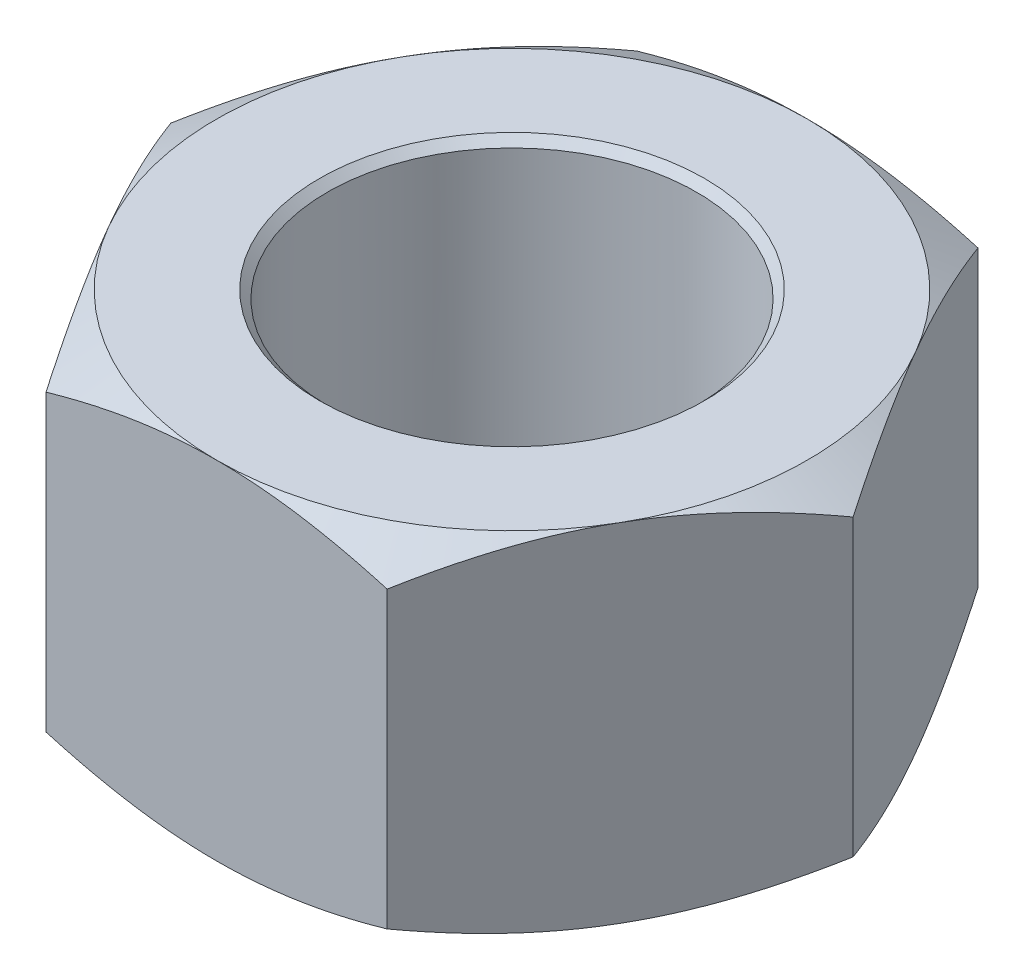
ISO-10303-21;
HEADER;
FILE_DESCRIPTION(('STEP AP214'),'2;1');
FILE_NAME('part.step','',(''),(''),'','','');
FILE_SCHEMA(('AUTOMOTIVE_DESIGN { 1 0 10303 214 1 1 1 1 }'));
ENDSEC;
DATA;
#1=APPLICATION_CONTEXT('core data for automotive mechanical design processes');
#2=APPLICATION_PROTOCOL_DEFINITION('international standard','automotive_design',2000,#1);
#3=PRODUCT_CONTEXT('',#1,'mechanical');
#4=PRODUCT('Part','Part','',(#3));
#5=PRODUCT_RELATED_PRODUCT_CATEGORY('part','',(#4));
#6=PRODUCT_DEFINITION_FORMATION('','',#4);
#7=PRODUCT_DEFINITION_CONTEXT('part definition',#1,'design');
#8=PRODUCT_DEFINITION('design','',#6,#7);
#9=PRODUCT_DEFINITION_SHAPE('','',#8);
#10=(LENGTH_UNIT() NAMED_UNIT(*) SI_UNIT(.MILLI.,.METRE.));
#11=(NAMED_UNIT(*) PLANE_ANGLE_UNIT() SI_UNIT($,.RADIAN.));
#12=(NAMED_UNIT(*) SI_UNIT($,.STERADIAN.) SOLID_ANGLE_UNIT());
#13=UNCERTAINTY_MEASURE_WITH_UNIT(LENGTH_MEASURE(1.E-05),#10,'distance_accuracy_value','');
#14=(GEOMETRIC_REPRESENTATION_CONTEXT(3) GLOBAL_UNCERTAINTY_ASSIGNED_CONTEXT((#13)) GLOBAL_UNIT_ASSIGNED_CONTEXT((#10,
#11,#12)) REPRESENTATION_CONTEXT('',''));
#15=CARTESIAN_POINT('',(0.,0.,0.));
#16=DIRECTION('',(0.,0.,1.));
#17=DIRECTION('',(1.,0.,0.));
#18=AXIS2_PLACEMENT_3D('',#15,#16,#17);
#19=CARTESIAN_POINT('',(0.,3.74341473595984,0.));
#20=DIRECTION('',(0.,-1.,0.));
#21=DIRECTION('',(0.,0.,-1.00000000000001));
#22=AXIS2_PLACEMENT_3D('',#19,#20,#21);
#23=CONICAL_SURFACE('',#22,5.65685424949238,1.04719754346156);
#24=CARTESIAN_POINT('',(-6.20839023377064,2.74543929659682,3.99999999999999));
#25=CARTESIAN_POINT('',(-6.03364521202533,2.83022662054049,3.99999999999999));
#26=CARTESIAN_POINT('',(-5.85849960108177,2.91420244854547,4.));
#27=CARTESIAN_POINT('',(-5.50719419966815,3.08007482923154,4.));
#28=CARTESIAN_POINT('',(-5.33103425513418,3.16197105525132,4.));
#29=CARTESIAN_POINT('',(-4.97658194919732,3.32363889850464,4.));
#30=CARTESIAN_POINT('',(-4.7982832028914,3.40339656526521,4.));
#31=CARTESIAN_POINT('',(-4.44026939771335,3.55965483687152,4.));
#32=CARTESIAN_POINT('',(-4.26055440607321,3.63615559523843,4.));
#33=CARTESIAN_POINT('',(-3.89359402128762,3.78744323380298,4.));
#34=CARTESIAN_POINT('',(-3.7062927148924,3.86209523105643,4.));
#35=CARTESIAN_POINT('',(-3.32950060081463,4.00576150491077,4.));
#36=CARTESIAN_POINT('',(-3.14000955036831,4.07477514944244,4.));
#37=CARTESIAN_POINT('',(-2.75888961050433,4.2053566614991,4.));
#38=CARTESIAN_POINT('',(-2.56726592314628,4.26693955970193,3.99999999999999));
#39=CARTESIAN_POINT('',(-2.18126966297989,4.38068672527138,4.));
#40=CARTESIAN_POINT('',(-1.98689797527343,4.43285395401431,4.));
#41=CARTESIAN_POINT('',(-1.59637994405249,4.5249904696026,4.));
#42=CARTESIAN_POINT('',(-1.40024960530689,4.56502634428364,4.));
#43=CARTESIAN_POINT('',(-1.00554432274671,4.63064250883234,3.99999999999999));
#44=CARTESIAN_POINT('',(-0.806969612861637,4.65622417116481,4.));
#45=CARTESIAN_POINT('',(-0.410963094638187,4.69055657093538,4.));
#46=CARTESIAN_POINT('',(-0.213550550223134,4.69952403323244,3.99999999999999));
#47=CARTESIAN_POINT('',(0.181330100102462,4.70043850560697,4.));
#48=CARTESIAN_POINT('',(0.378798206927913,4.69238521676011,4.00000000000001));
#49=CARTESIAN_POINT('',(0.713893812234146,4.66484679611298,4.));
#50=CARTESIAN_POINT('',(0.851879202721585,4.64946625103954,4.));
#51=CARTESIAN_POINT('',(1.12683713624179,4.61134898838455,3.99999999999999));
#52=CARTESIAN_POINT('',(1.2638095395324,4.58861127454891,3.99999999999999));
#53=CARTESIAN_POINT('',(1.6730269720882,4.51055772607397,4.));
#54=CARTESIAN_POINT('',(1.94341853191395,4.44541579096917,3.99999999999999));
#55=CARTESIAN_POINT('',(2.34772228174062,4.33249577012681,4.));
#56=CARTESIAN_POINT('',(2.4837313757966,4.29179820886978,4.));
#57=CARTESIAN_POINT('',(2.75442830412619,4.20618524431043,3.99999999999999));
#58=CARTESIAN_POINT('',(2.88911612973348,4.16126981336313,3.99999999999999));
#59=CARTESIAN_POINT('',(3.1572132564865,4.06794111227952,4.));
#60=CARTESIAN_POINT('',(3.29062296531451,4.01952900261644,4.00000000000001));
#61=CARTESIAN_POINT('',(3.55633779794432,3.91977556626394,3.99999999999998));
#62=CARTESIAN_POINT('',(3.68864293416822,3.86843427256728,3.99999999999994));
#63=CARTESIAN_POINT('',(3.99869432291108,3.74479696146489,3.99999999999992));
#64=CARTESIAN_POINT('',(4.17603604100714,3.67148839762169,3.99999999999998));
#65=CARTESIAN_POINT('',(4.52922449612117,3.52134465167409,4.00000000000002));
#66=CARTESIAN_POINT('',(4.70507114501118,3.44450926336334,4.));
#67=CARTESIAN_POINT('',(5.05554185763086,3.28801427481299,3.99999999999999));
#68=CARTESIAN_POINT('',(5.23016567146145,3.20835411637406,3.99999999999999));
#69=CARTESIAN_POINT('',(5.57836241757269,3.04676587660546,4.));
#70=CARTESIAN_POINT('',(5.75193532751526,2.96483774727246,4.));
#71=CARTESIAN_POINT('',(6.27167633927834,2.71614673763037,3.99999999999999));
#72=CARTESIAN_POINT('',(6.61652656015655,2.54663124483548,3.99999999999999));
#73=CARTESIAN_POINT('',(7.30373366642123,2.20262130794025,3.99999999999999));
#74=CARTESIAN_POINT('',(7.64609046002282,2.02812668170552,3.99999999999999));
#75=CARTESIAN_POINT('',(8.30062488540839,1.69022939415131,3.99999999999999));
#76=CARTESIAN_POINT('',(8.61294829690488,1.52710859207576,3.99999999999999));
#77=CARTESIAN_POINT('',(9.23642594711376,1.19862534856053,3.99999999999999));
#78=CARTESIAN_POINT('',(9.54758014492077,1.03326282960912,3.99999999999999));
#79=CARTESIAN_POINT('',(10.168207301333,0.701236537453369,3.99999999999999));
#80=CARTESIAN_POINT('',(10.4776825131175,0.534576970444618,3.99999999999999));
#81=CARTESIAN_POINT('',(11.095883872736,0.199913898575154,3.99999999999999));
#82=CARTESIAN_POINT('',(11.4046100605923,0.0319104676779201,3.99999999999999));
#83=CARTESIAN_POINT('',(11.7130599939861,-0.136594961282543,3.99999999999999));
#84=B_SPLINE_CURVE_WITH_KNOTS('',3,(#24,#25,#26,#27,#28,#29,#30,#31,#32,#33,#34,#35,#36,#37,#38,
#39,#40,#41,#42,#43,#44,#45,#46,#47,#48,#49,#50,#51,#52,#53,#54,#55,#56,#57,#58,#59,#60,#61,#62,
#63,#64,#65,#66,#67,#68,#69,#70,#71,#72,#73,#74,#75,#76,#77,#78,#79,#80,#81,#82,#83),
.UNSPECIFIED.,.F.,.F.,(4,2,2,2,2,2,2,2,2,2,2,2,2,2,2,2,2,2,2,2,2,2,2,2,2,2,2,2,2,4),(0.,
0.58269261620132,1.16547620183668,1.75142413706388,2.33734442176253,2.94216458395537,
3.54705245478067,4.15069550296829,4.7541483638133,5.35422628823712,5.95424722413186,
6.5463845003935,7.13853217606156,7.55485008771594,7.97122439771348,8.80443398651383,
9.23030042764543,9.65616966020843,10.0818981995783,10.507621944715,11.0832599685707,
11.6589316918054,12.2347178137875,12.8105161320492,13.9632327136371,15.1159915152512,
16.1730456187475,17.2301363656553,18.2846244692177,19.3390549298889),.UNSPECIFIED.);
#85=CARTESIAN_POINT('',(0.,4.7,4.));
#86=VERTEX_POINT('',#85);
#87=CARTESIAN_POINT('',(2.30940107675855,4.3427344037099,3.99999999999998));
#88=VERTEX_POINT('',#87);
#89=EDGE_CURVE('E138',#86,#88,#84,.T.);
#90=ORIENTED_EDGE('',*,*,#89,.T.);
#91=CARTESIAN_POINT('',(2.30928560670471,4.3426677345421,4.00019999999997));
#92=CARTESIAN_POINT('',(2.41077174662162,4.40128212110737,3.82442084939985));
#93=CARTESIAN_POINT('',(2.51313390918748,4.45458967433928,3.64712438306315));
#94=CARTESIAN_POINT('',(2.71963072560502,4.54763832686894,3.28946140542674));
#95=CARTESIAN_POINT('',(2.82376904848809,4.58734650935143,3.10908853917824));
#96=CARTESIAN_POINT('',(3.03075510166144,4.64915778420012,2.75057817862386));
#97=CARTESIAN_POINT('',(3.13357098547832,4.6716722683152,2.57249584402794));
#98=CARTESIAN_POINT('',(3.33968651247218,4.69854937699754,2.21549327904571));
#99=CARTESIAN_POINT('',(3.44298540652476,4.70293425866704,2.03657434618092));
#100=CARTESIAN_POINT('',(3.63600352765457,4.69380992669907,1.7022571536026));
#101=CARTESIAN_POINT('',(3.72575165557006,4.68254104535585,1.54680883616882));
#102=CARTESIAN_POINT('',(3.90466320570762,4.64682600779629,1.23692494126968));
#103=CARTESIAN_POINT('',(3.99382600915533,4.62236765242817,1.08249043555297));
#104=CARTESIAN_POINT('',(4.17310641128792,4.56122393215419,0.771967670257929));
#105=CARTESIAN_POINT('',(4.26320132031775,4.5242793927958,0.615918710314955));
#106=CARTESIAN_POINT('',(4.44204742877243,4.44042992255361,0.306148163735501));
#107=CARTESIAN_POINT('',(4.53080091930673,4.39354469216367,0.152422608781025));
#108=CARTESIAN_POINT('',(4.6189176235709,4.3426677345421,-0.000200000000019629));
#109=B_SPLINE_CURVE_WITH_KNOTS('',3,(#91,#92,#93,#94,#95,#96,#97,#98,#99,#100,#101,#102,#103,
#104,#105,#106,#107,#108),.UNSPECIFIED.,.F.,.F.,(4,2,2,2,2,2,2,2,4),(0.,0.634047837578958,
1.26961969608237,1.88946157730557,2.50854227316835,3.04757825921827,3.58711366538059,
4.13861653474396,4.6890364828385),.UNSPECIFIED.);
#110=CARTESIAN_POINT('',(3.46410161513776,4.7,1.99999999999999));
#111=VERTEX_POINT('',#110);
#112=EDGE_CURVE('E147',#88,#111,#109,.T.);
#113=ORIENTED_EDGE('',*,*,#112,.T.);
#114=CARTESIAN_POINT('',(0.,4.7,0.));
#115=DIRECTION('',(0.,1.,0.));
#116=DIRECTION('',(0.,0.,1.00000000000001));
#117=AXIS2_PLACEMENT_3D('',#114,#115,#116);
#118=CIRCLE('',#117,4.);
#119=EDGE_CURVE('E158',#86,#111,#118,.T.);
#120=ORIENTED_EDGE('',*,*,#119,.F.);
#121=EDGE_LOOP('',(#90,#113,#120));
#122=FACE_BOUND('',#121,.T.);
#123=ADVANCED_FACE('F35',(#122),#23,.T.);
#124=CARTESIAN_POINT('',(3.46410161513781,4.7000000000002,-2.00000000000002));
#125=VERTEX_POINT('',#124);
#126=EDGE_CURVE('E170',#111,#125,#118,.T.);
#127=ORIENTED_EDGE('',*,*,#126,.F.);
#128=CARTESIAN_POINT('',(4.61880215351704,4.3427344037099,0.));
#129=VERTEX_POINT('',#128);
#130=EDGE_CURVE('E161',#111,#129,#109,.T.);
#131=ORIENTED_EDGE('',*,*,#130,.T.);
#132=CARTESIAN_POINT('',(4.61891762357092,4.3426677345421,0.000199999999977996));
#133=CARTESIAN_POINT('',(4.517431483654,4.40128212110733,-0.175579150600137));
#134=CARTESIAN_POINT('',(4.41506932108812,4.45458967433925,-0.352875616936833));
#135=CARTESIAN_POINT('',(4.20857250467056,4.54763832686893,-0.710538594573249));
#136=CARTESIAN_POINT('',(4.10443418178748,4.58734650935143,-0.89091146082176));
#137=CARTESIAN_POINT('',(3.89744812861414,4.64915778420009,-1.24942182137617));
#138=CARTESIAN_POINT('',(3.79463224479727,4.67167226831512,-1.4275041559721));
#139=CARTESIAN_POINT('',(3.58851671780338,4.69854937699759,-1.78450672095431));
#140=CARTESIAN_POINT('',(3.48521782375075,4.70293425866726,-1.96342565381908));
#141=CARTESIAN_POINT('',(3.29219970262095,4.69380992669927,-2.29774284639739));
#142=CARTESIAN_POINT('',(3.20245157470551,4.68254104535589,-2.45319116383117));
#143=CARTESIAN_POINT('',(3.02354002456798,4.64682600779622,-2.76307505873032));
#144=CARTESIAN_POINT('',(2.93437722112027,4.62236765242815,-2.91750956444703));
#145=CARTESIAN_POINT('',(2.75509681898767,4.56122393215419,-3.22803232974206));
#146=CARTESIAN_POINT('',(2.66500190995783,4.52427939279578,-3.38408128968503));
#147=CARTESIAN_POINT('',(2.48615580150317,4.44042992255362,-3.6938518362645));
#148=CARTESIAN_POINT('',(2.39740231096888,4.39354469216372,-3.847577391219));
#149=CARTESIAN_POINT('',(2.30928560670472,4.34266773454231,-4.00020000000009));
#150=B_SPLINE_CURVE_WITH_KNOTS('',3,(#132,#133,#134,#135,#136,#137,#138,#139,#140,#141,#142,
#143,#144,#145,#146,#147,#148,#149),.UNSPECIFIED.,.F.,.F.,(4,2,2,2,2,2,2,2,4),(0.,
0.634047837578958,1.26961969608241,1.88946157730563,2.5085422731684,3.04757825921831,
3.58711366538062,4.13861653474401,4.68903648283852),.UNSPECIFIED.);
#151=EDGE_CURVE('E240',#129,#125,#150,.T.);
#152=ORIENTED_EDGE('',*,*,#151,.T.);
#153=EDGE_LOOP('',(#127,#131,#152));
#154=FACE_BOUND('',#153,.T.);
#155=ADVANCED_FACE('F191',(#154),#23,.T.);
#156=CARTESIAN_POINT('',(0.,4.7000000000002,-3.99999999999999));
#157=VERTEX_POINT('',#156);
#158=EDGE_CURVE('E233',#125,#157,#118,.T.);
#159=ORIENTED_EDGE('',*,*,#158,.F.);
#160=CARTESIAN_POINT('',(2.30940107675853,4.34273440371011,-4.00000000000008));
#161=VERTEX_POINT('',#160);
#162=EDGE_CURVE('E244',#125,#161,#150,.T.);
#163=ORIENTED_EDGE('',*,*,#162,.T.);
#164=CARTESIAN_POINT('',(-6.20839023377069,2.74543929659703,-4.00000000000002));
#165=CARTESIAN_POINT('',(-6.03364521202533,2.83022662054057,-4.00000000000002));
#166=CARTESIAN_POINT('',(-5.85849960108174,2.9142024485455,-4.00000000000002));
#167=CARTESIAN_POINT('',(-5.50719419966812,3.08007482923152,-4.00000000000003));
#168=CARTESIAN_POINT('',(-5.33103425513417,3.16197105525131,-4.00000000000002));
#169=CARTESIAN_POINT('',(-4.97658194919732,3.32363889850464,-4.00000000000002));
#170=CARTESIAN_POINT('',(-4.79828320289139,3.40339656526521,-4.00000000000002));
#171=CARTESIAN_POINT('',(-4.44026939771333,3.55965483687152,-4.00000000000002));
#172=CARTESIAN_POINT('',(-4.26055440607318,3.63615559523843,-4.00000000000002));
#173=CARTESIAN_POINT('',(-3.89359402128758,3.78744323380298,-4.00000000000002));
#174=CARTESIAN_POINT('',(-3.70629271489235,3.86209523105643,-4.00000000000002));
#175=CARTESIAN_POINT('',(-3.32950060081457,4.00576150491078,-4.00000000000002));
#176=CARTESIAN_POINT('',(-3.14000955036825,4.07477514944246,-4.00000000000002));
#177=CARTESIAN_POINT('',(-2.75888961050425,4.2053566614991,-4.00000000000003));
#178=CARTESIAN_POINT('',(-2.5672659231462,4.26693955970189,-4.00000000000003));
#179=CARTESIAN_POINT('',(-2.18126966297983,4.38068672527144,-4.00000000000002));
#180=CARTESIAN_POINT('',(-1.98689797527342,4.43285395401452,-3.99999999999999));
#181=CARTESIAN_POINT('',(-1.5963799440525,4.52499046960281,-3.99999999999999));
#182=CARTESIAN_POINT('',(-1.40024960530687,4.56502634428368,-4.00000000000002));
#183=CARTESIAN_POINT('',(-1.00554432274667,4.63064250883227,-4.00000000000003));
#184=CARTESIAN_POINT('',(-0.806969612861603,4.6562241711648,-4.00000000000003));
#185=CARTESIAN_POINT('',(-0.410963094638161,4.69055657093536,-4.00000000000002));
#186=CARTESIAN_POINT('',(-0.213550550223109,4.69952403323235,-4.00000000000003));
#187=CARTESIAN_POINT('',(0.181330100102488,4.70043850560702,-4.00000000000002));
#188=CARTESIAN_POINT('',(0.378798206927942,4.69238521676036,-4.00000000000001));
#189=CARTESIAN_POINT('',(0.713893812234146,4.66484679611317,-4.00000000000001));
#190=CARTESIAN_POINT('',(0.851879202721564,4.64946625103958,-4.00000000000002));
#191=CARTESIAN_POINT('',(1.12683713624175,4.61134898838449,-4.00000000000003));
#192=CARTESIAN_POINT('',(1.26380953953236,4.58861127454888,-4.00000000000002));
#193=CARTESIAN_POINT('',(1.67302697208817,4.510557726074,-4.00000000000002));
#194=CARTESIAN_POINT('',(1.94341853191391,4.44541579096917,-4.00000000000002));
#195=CARTESIAN_POINT('',(2.34772228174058,4.3324957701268,-4.00000000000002));
#196=CARTESIAN_POINT('',(2.48373137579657,4.29179820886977,-4.00000000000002));
#197=CARTESIAN_POINT('',(2.75442830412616,4.20618524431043,-4.00000000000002));
#198=CARTESIAN_POINT('',(2.88911612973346,4.16126981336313,-4.00000000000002));
#199=CARTESIAN_POINT('',(3.15721325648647,4.06794111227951,-4.00000000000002));
#200=CARTESIAN_POINT('',(3.29062296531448,4.01952900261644,-4.00000000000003));
#201=CARTESIAN_POINT('',(3.5563377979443,3.91977556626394,-4.00000000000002));
#202=CARTESIAN_POINT('',(3.68864293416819,3.86843427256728,-4.));
#203=CARTESIAN_POINT('',(3.99869432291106,3.74479696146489,-4.));
#204=CARTESIAN_POINT('',(4.17603604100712,3.67148839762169,-4.00000000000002));
#205=CARTESIAN_POINT('',(4.52922449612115,3.52134465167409,-4.00000000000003));
#206=CARTESIAN_POINT('',(4.70507114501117,3.44450926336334,-4.00000000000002));
#207=CARTESIAN_POINT('',(5.05554185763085,3.28801427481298,-4.00000000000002));
#208=CARTESIAN_POINT('',(5.23016567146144,3.20835411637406,-4.00000000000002));
#209=CARTESIAN_POINT('',(5.57836241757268,3.04676587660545,-4.00000000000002));
#210=CARTESIAN_POINT('',(5.75193532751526,2.96483774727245,-4.00000000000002));
#211=CARTESIAN_POINT('',(6.27167633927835,2.71614673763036,-4.00000000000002));
#212=CARTESIAN_POINT('',(6.61652656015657,2.54663124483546,-4.00000000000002));
#213=CARTESIAN_POINT('',(7.30373366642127,2.20262130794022,-4.00000000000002));
#214=CARTESIAN_POINT('',(7.64609046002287,2.02812668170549,-4.00000000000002));
#215=CARTESIAN_POINT('',(8.30062488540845,1.69022939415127,-4.00000000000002));
#216=CARTESIAN_POINT('',(8.61294829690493,1.52710859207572,-4.00000000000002));
#217=CARTESIAN_POINT('',(9.23642594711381,1.1986253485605,-4.00000000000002));
#218=CARTESIAN_POINT('',(9.54758014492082,1.03326282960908,-4.00000000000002));
#219=CARTESIAN_POINT('',(10.168207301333,0.701236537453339,-4.00000000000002));
#220=CARTESIAN_POINT('',(10.4776825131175,0.53457697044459,-4.00000000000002));
#221=CARTESIAN_POINT('',(11.095883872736,0.199913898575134,-4.00000000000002));
#222=CARTESIAN_POINT('',(11.4046100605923,0.0319104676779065,-4.00000000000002));
#223=CARTESIAN_POINT('',(11.7130599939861,-0.136594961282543,-4.00000000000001));
#224=B_SPLINE_CURVE_WITH_KNOTS('',3,(#164,#165,#166,#167,#168,#169,#170,#171,#172,#173,#174,
#175,#176,#177,#178,#179,#180,#181,#182,#183,#184,#185,#186,#187,#188,#189,#190,#191,#192,#193,
#194,#195,#196,#197,#198,#199,#200,#201,#202,#203,#204,#205,#206,#207,#208,#209,#210,#211,#212,
#213,#214,#215,#216,#217,#218,#219,#220,#221,#222,#223),.UNSPECIFIED.,.F.,.F.,(4,2,2,2,2,2,2,2,
2,2,2,2,2,2,2,2,2,2,2,2,2,2,2,2,2,2,2,2,2,4),(0.,0.582692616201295,1.16547620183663,
1.75142413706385,2.33734442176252,2.94216458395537,3.54705245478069,4.15069550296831,
4.7541483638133,5.35422628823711,5.95424722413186,6.54638450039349,7.13853217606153,
7.55485008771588,7.97122439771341,8.80443398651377,9.23030042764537,9.65616966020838,
10.0818981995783,10.507621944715,11.0832599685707,11.6589316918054,12.2347178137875,
12.8105161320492,13.9632327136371,15.1159915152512,16.1730456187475,17.2301363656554,
18.2846244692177,19.3390549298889),.UNSPECIFIED.);
#225=EDGE_CURVE('E249',#161,#157,#224,.F.);
#226=ORIENTED_EDGE('',*,*,#225,.T.);
#227=EDGE_LOOP('',(#159,#163,#226));
#228=FACE_BOUND('',#227,.T.);
#229=ADVANCED_FACE('F197',(#228),#23,.T.);
#230=CARTESIAN_POINT('',(-3.46410161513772,4.7,-1.99999999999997));
#231=VERTEX_POINT('',#230);
#232=EDGE_CURVE('E228',#157,#231,#118,.T.);
#233=ORIENTED_EDGE('',*,*,#232,.F.);
#234=CARTESIAN_POINT('',(-2.30940107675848,4.34273440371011,-4.00000000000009));
#235=VERTEX_POINT('',#234);
#236=EDGE_CURVE('E254',#157,#235,#224,.F.);
#237=ORIENTED_EDGE('',*,*,#236,.T.);
#238=CARTESIAN_POINT('',(-2.30928560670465,4.34266773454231,-4.00020000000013));
#239=CARTESIAN_POINT('',(-2.41077174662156,4.40128212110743,-3.82442084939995));
#240=CARTESIAN_POINT('',(-2.51313390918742,4.45458967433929,-3.64712438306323));
#241=CARTESIAN_POINT('',(-2.71963072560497,4.54763832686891,-3.28946140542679));
#242=CARTESIAN_POINT('',(-2.82376904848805,4.58734650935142,-3.10908853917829));
#243=CARTESIAN_POINT('',(-3.0307551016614,4.64915778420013,-2.7505781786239));
#244=CARTESIAN_POINT('',(-3.13357098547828,4.67167226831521,-2.57249584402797));
#245=CARTESIAN_POINT('',(-3.33968651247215,4.69854937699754,-2.21549327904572));
#246=CARTESIAN_POINT('',(-3.44298540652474,4.70293425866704,-2.03657434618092));
#247=CARTESIAN_POINT('',(-3.63600352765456,4.69380992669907,-1.7022571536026));
#248=CARTESIAN_POINT('',(-3.72575165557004,4.68254104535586,-1.54680883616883));
#249=CARTESIAN_POINT('',(-3.9046632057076,4.6468260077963,-1.23692494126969));
#250=CARTESIAN_POINT('',(-3.9938260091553,4.62236765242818,-1.08249043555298));
#251=CARTESIAN_POINT('',(-4.17310641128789,4.56122393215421,-0.771967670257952));
#252=CARTESIAN_POINT('',(-4.26320132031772,4.52427939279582,-0.615918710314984));
#253=CARTESIAN_POINT('',(-4.44204742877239,4.44042992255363,-0.306148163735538));
#254=CARTESIAN_POINT('',(-4.53080091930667,4.39354469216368,-0.152422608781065));
#255=CARTESIAN_POINT('',(-4.61891762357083,4.3426677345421,0.000199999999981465));
#256=B_SPLINE_CURVE_WITH_KNOTS('',3,(#238,#239,#240,#241,#242,#243,#244,#245,#246,#247,#248,
#249,#250,#251,#252,#253,#254,#255),.UNSPECIFIED.,.F.,.F.,(4,2,2,2,2,2,2,2,4),(0.,
0.634047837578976,1.26961969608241,1.88946157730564,2.50854227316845,3.04757825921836,
3.58711366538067,4.13861653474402,4.68903648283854),.UNSPECIFIED.);
#257=EDGE_CURVE('E327',#235,#231,#256,.T.);
#258=ORIENTED_EDGE('',*,*,#257,.T.);
#259=EDGE_LOOP('',(#233,#237,#258));
#260=FACE_BOUND('',#259,.T.);
#261=ADVANCED_FACE('F212',(#260),#23,.T.);
#262=CARTESIAN_POINT('',(-3.46410161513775,4.7,1.99999999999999));
#263=VERTEX_POINT('',#262);
#264=EDGE_CURVE('E156',#231,#263,#118,.T.);
#265=ORIENTED_EDGE('',*,*,#264,.F.);
#266=CARTESIAN_POINT('',(-4.61880215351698,4.3427344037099,0.));
#267=VERTEX_POINT('',#266);
#268=EDGE_CURVE('E226',#231,#267,#256,.T.);
#269=ORIENTED_EDGE('',*,*,#268,.T.);
#270=CARTESIAN_POINT('',(-4.61891762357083,4.3426677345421,-0.000200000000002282));
#271=CARTESIAN_POINT('',(-4.51743148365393,4.40128212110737,0.175579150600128));
#272=CARTESIAN_POINT('',(-4.41506932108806,4.45458967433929,0.352875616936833));
#273=CARTESIAN_POINT('',(-4.20857250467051,4.54763832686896,0.710538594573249));
#274=CARTESIAN_POINT('',(-4.10443418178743,4.58734650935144,0.89091146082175));
#275=CARTESIAN_POINT('',(-3.89744812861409,4.64915778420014,1.24942182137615));
#276=CARTESIAN_POINT('',(-3.79463224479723,4.67167226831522,1.42750415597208));
#277=CARTESIAN_POINT('',(-3.58851671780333,4.69854937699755,1.7845067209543));
#278=CARTESIAN_POINT('',(-3.4852178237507,4.70293425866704,1.96342565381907));
#279=CARTESIAN_POINT('',(-3.29219970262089,4.69380992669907,2.29774284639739));
#280=CARTESIAN_POINT('',(-3.20245157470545,4.68254104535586,2.45319116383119));
#281=CARTESIAN_POINT('',(-3.02354002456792,4.6468260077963,2.76307505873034));
#282=CARTESIAN_POINT('',(-2.93437722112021,4.62236765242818,2.91750956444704));
#283=CARTESIAN_POINT('',(-2.75509681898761,4.5612239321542,3.22803232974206));
#284=CARTESIAN_POINT('',(-2.66500190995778,4.52427939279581,3.38408128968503));
#285=CARTESIAN_POINT('',(-2.48615580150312,4.44042992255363,3.69385183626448));
#286=CARTESIAN_POINT('',(-2.39740231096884,4.39354469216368,3.84757739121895));
#287=CARTESIAN_POINT('',(-2.30928560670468,4.3426677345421,4.0002));
#288=B_SPLINE_CURVE_WITH_KNOTS('',3,(#270,#271,#272,#273,#274,#275,#276,#277,#278,#279,#280,
#281,#282,#283,#284,#285,#286,#287),.UNSPECIFIED.,.F.,.F.,(4,2,2,2,2,2,2,2,4),(0.,
0.634047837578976,1.2696196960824,1.88946157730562,2.50854227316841,3.04757825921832,
3.58711366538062,4.13861653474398,4.68903648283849),.UNSPECIFIED.);
#289=EDGE_CURVE('E227',#267,#263,#288,.T.);
#290=ORIENTED_EDGE('',*,*,#289,.T.);
#291=EDGE_LOOP('',(#265,#269,#290));
#292=FACE_BOUND('',#291,.T.);
#293=ADVANCED_FACE('F204',(#292),#23,.T.);
#294=CARTESIAN_POINT('',(0.,0.,0.));
#295=DIRECTION('',(0.,1.,0.));
#296=DIRECTION('',(0.,0.,1.00000000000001));
#297=AXIS2_PLACEMENT_3D('',#294,#295,#296);
#298=CONICAL_SURFACE('',#297,4.,1.04719754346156);
#299=CARTESIAN_POINT('',(-4.61891762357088,0.357332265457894,0.000199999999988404));
#300=CARTESIAN_POINT('',(-4.51743148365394,0.298717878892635,-0.175579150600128));
#301=CARTESIAN_POINT('',(-4.41506932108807,0.245410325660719,-0.352875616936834));
#302=CARTESIAN_POINT('',(-4.20857250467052,0.152361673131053,-0.710538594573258));
#303=CARTESIAN_POINT('',(-4.10443418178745,0.112653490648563,-0.890911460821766));
#304=CARTESIAN_POINT('',(-3.89744812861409,0.050842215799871,-1.24942182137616));
#305=CARTESIAN_POINT('',(-3.7946322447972,0.0283277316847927,-1.42750415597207));
#306=CARTESIAN_POINT('',(-3.58851671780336,0.00145062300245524,-1.78450672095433));
#307=CARTESIAN_POINT('',(-3.48521782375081,-0.00293425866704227,-1.96342565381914));
#308=CARTESIAN_POINT('',(-3.29219970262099,0.00619007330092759,-2.29774284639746));
#309=CARTESIAN_POINT('',(-3.20245157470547,0.0174589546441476,-2.45319116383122));
#310=CARTESIAN_POINT('',(-3.02354002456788,0.0531739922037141,-2.76307505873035));
#311=CARTESIAN_POINT('',(-2.93437722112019,0.0776323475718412,-2.91750956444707));
#312=CARTESIAN_POINT('',(-2.7550968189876,0.13877606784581,-3.22803232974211));
#313=CARTESIAN_POINT('',(-2.66500190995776,0.175720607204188,-3.38408128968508));
#314=CARTESIAN_POINT('',(-2.4861558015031,0.259570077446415,-3.69385183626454));
#315=CARTESIAN_POINT('',(-2.39740231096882,0.306455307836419,-3.84757739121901));
#316=CARTESIAN_POINT('',(-2.30928560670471,0.357332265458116,-4.00020000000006));
#317=B_SPLINE_CURVE_WITH_KNOTS('',3,(#299,#300,#301,#302,#303,#304,#305,#306,#307,#308,#309,
#310,#311,#312,#313,#314,#315,#316),.UNSPECIFIED.,.F.,.F.,(4,2,2,2,2,2,2,2,4),(0.,
0.634047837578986,1.26961969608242,1.88946157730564,2.50854227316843,3.04757825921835,
3.58711366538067,4.13861653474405,4.68903648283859),.UNSPECIFIED.);
#318=CARTESIAN_POINT('',(-3.46410161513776,0.,-1.99999999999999));
#319=VERTEX_POINT('',#318);
#320=CARTESIAN_POINT('',(-2.30940107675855,0.357265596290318,-4.00000000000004));
#321=VERTEX_POINT('',#320);
#322=EDGE_CURVE('E314',#319,#321,#317,.T.);
#323=ORIENTED_EDGE('',*,*,#322,.T.);
#324=CARTESIAN_POINT('',(-6.20839023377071,1.95456070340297,-4.00000000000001));
#325=CARTESIAN_POINT('',(-6.03364521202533,1.86977337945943,-4.00000000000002));
#326=CARTESIAN_POINT('',(-5.85849960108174,1.78579755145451,-4.00000000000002));
#327=CARTESIAN_POINT('',(-5.50719419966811,1.61992517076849,-4.00000000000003));
#328=CARTESIAN_POINT('',(-5.33103425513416,1.53802894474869,-4.00000000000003));
#329=CARTESIAN_POINT('',(-4.97658194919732,1.37636110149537,-4.00000000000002));
#330=CARTESIAN_POINT('',(-4.7982832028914,1.29660343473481,-4.00000000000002));
#331=CARTESIAN_POINT('',(-4.44026939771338,1.14034516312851,-4.00000000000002));
#332=CARTESIAN_POINT('',(-4.26055440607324,1.0638444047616,-4.00000000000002));
#333=CARTESIAN_POINT('',(-3.89359402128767,0.912556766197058,-4.00000000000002));
#334=CARTESIAN_POINT('',(-3.70629271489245,0.837904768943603,-4.00000000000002));
#335=CARTESIAN_POINT('',(-3.32950060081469,0.694238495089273,-4.00000000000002));
#336=CARTESIAN_POINT('',(-3.14000955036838,0.625224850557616,-4.00000000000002));
#337=CARTESIAN_POINT('',(-2.75888961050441,0.494643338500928,-4.00000000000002));
#338=CARTESIAN_POINT('',(-2.56726592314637,0.433060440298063,-4.00000000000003));
#339=CARTESIAN_POINT('',(-2.18126966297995,0.319313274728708,-4.00000000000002));
#340=CARTESIAN_POINT('',(-1.98689797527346,0.267146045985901,-4.00000000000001));
#341=CARTESIAN_POINT('',(-1.59637994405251,0.175009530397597,-4.00000000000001));
#342=CARTESIAN_POINT('',(-1.40024960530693,0.134973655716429,-4.00000000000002));
#343=CARTESIAN_POINT('',(-1.00554432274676,0.0693574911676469,-4.00000000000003));
#344=CARTESIAN_POINT('',(-0.806969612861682,0.0437758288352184,-4.00000000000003));
#345=CARTESIAN_POINT('',(-0.410963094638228,0.00944342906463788,-4.00000000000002));
#346=CARTESIAN_POINT('',(-0.213550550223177,0.000475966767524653,-4.00000000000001));
#347=CARTESIAN_POINT('',(0.181330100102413,-0.000438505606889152,-4.00000000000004));
#348=CARTESIAN_POINT('',(0.37879820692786,0.00761478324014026,-4.00000000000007));
#349=CARTESIAN_POINT('',(0.713893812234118,0.0351532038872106,-4.00000000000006));
#350=CARTESIAN_POINT('',(0.85187920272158,0.0505337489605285,-4.00000000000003));
#351=CARTESIAN_POINT('',(1.12683713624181,0.0886510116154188,-4.00000000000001));
#352=CARTESIAN_POINT('',(1.26380953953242,0.1113887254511,-4.00000000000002));
#353=CARTESIAN_POINT('',(1.67302697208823,0.189442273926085,-4.00000000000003));
#354=CARTESIAN_POINT('',(1.94341853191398,0.254584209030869,-4.00000000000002));
#355=CARTESIAN_POINT('',(2.34772228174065,0.367504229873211,-4.00000000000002));
#356=CARTESIAN_POINT('',(2.48373137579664,0.408201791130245,-4.00000000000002));
#357=CARTESIAN_POINT('',(2.75442830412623,0.493814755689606,-4.00000000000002));
#358=CARTESIAN_POINT('',(2.88911612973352,0.53873018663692,-4.00000000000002));
#359=CARTESIAN_POINT('',(3.15721325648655,0.632058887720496,-4.00000000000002));
#360=CARTESIAN_POINT('',(3.2906229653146,0.680470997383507,-4.00000000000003));
#361=CARTESIAN_POINT('',(3.55633779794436,0.780224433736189,-4.00000000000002));
#362=CARTESIAN_POINT('',(3.68864293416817,0.83156572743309,-4.00000000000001));
#363=CARTESIAN_POINT('',(3.99869432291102,0.955203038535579,-4.00000000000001));
#364=CARTESIAN_POINT('',(4.17603604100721,1.02851160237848,-4.00000000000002));
#365=CARTESIAN_POINT('',(4.52922449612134,1.17865534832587,-4.00000000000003));
#366=CARTESIAN_POINT('',(4.70507114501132,1.2554907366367,-4.00000000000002));
#367=CARTESIAN_POINT('',(5.05554185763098,1.41198572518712,-4.00000000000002));
#368=CARTESIAN_POINT('',(5.23016567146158,1.49164588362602,-4.00000000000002));
#369=CARTESIAN_POINT('',(5.57836241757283,1.65323412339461,-4.00000000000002));
#370=CARTESIAN_POINT('',(5.7519353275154,1.73516225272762,-4.00000000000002));
#371=CARTESIAN_POINT('',(6.27167633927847,1.98385326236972,-4.00000000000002));
#372=CARTESIAN_POINT('',(6.61652656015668,2.1533687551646,-4.00000000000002));
#373=CARTESIAN_POINT('',(7.30373366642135,2.49737869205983,-4.00000000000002));
#374=CARTESIAN_POINT('',(7.64609046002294,2.67187331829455,-4.00000000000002));
#375=CARTESIAN_POINT('',(8.30062488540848,3.00977060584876,-4.00000000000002));
#376=CARTESIAN_POINT('',(8.61294829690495,3.1728914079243,-4.00000000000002));
#377=CARTESIAN_POINT('',(9.2364259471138,3.5013746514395,-4.00000000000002));
#378=CARTESIAN_POINT('',(9.54758014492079,3.66673717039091,-4.00000000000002));
#379=CARTESIAN_POINT('',(10.168207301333,3.99876346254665,-4.00000000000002));
#380=CARTESIAN_POINT('',(10.4776825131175,4.1654230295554,-4.00000000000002));
#381=CARTESIAN_POINT('',(11.095883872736,4.50008610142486,-4.00000000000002));
#382=CARTESIAN_POINT('',(11.4046100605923,4.66808953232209,-4.00000000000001));
#383=CARTESIAN_POINT('',(11.713059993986,4.83659496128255,-4.));
#384=B_SPLINE_CURVE_WITH_KNOTS('',3,(#324,#325,#326,#327,#328,#329,#330,#331,#332,#333,#334,
#335,#336,#337,#338,#339,#340,#341,#342,#343,#344,#345,#346,#347,#348,#349,#350,#351,#352,#353,
#354,#355,#356,#357,#358,#359,#360,#361,#362,#363,#364,#365,#366,#367,#368,#369,#370,#371,#372,
#373,#374,#375,#376,#377,#378,#379,#380,#381,#382,#383),.UNSPECIFIED.,.F.,.F.,(4,2,2,2,2,2,2,2,
2,2,2,2,2,2,2,2,2,2,2,2,2,2,2,2,2,2,2,2,2,4),(0.,0.582692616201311,1.16547620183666,
1.75142413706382,2.33734442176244,2.94216458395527,3.54705245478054,4.15069550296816,
4.75414836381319,5.35422628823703,5.95424722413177,6.54638450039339,7.13853217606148,
7.55485008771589,7.97122439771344,8.8044339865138,9.23030042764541,9.65616966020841,
10.0818981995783,10.5076219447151,11.0832599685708,11.6589316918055,12.2347178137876,
12.8105161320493,13.9632327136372,15.1159915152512,16.1730456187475,17.2301363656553,
18.2846244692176,19.3390549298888),.UNSPECIFIED.);
#385=CARTESIAN_POINT('',(0.,2.08166817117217E-13,-4.00000000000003));
#386=VERTEX_POINT('',#385);
#387=EDGE_CURVE('E259',#321,#386,#384,.T.);
#388=ORIENTED_EDGE('',*,*,#387,.T.);
#389=CARTESIAN_POINT('',(0.,0.,0.));
#390=DIRECTION('',(0.,1.,0.));
#391=DIRECTION('',(0.,0.,1.00000000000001));
#392=AXIS2_PLACEMENT_3D('',#389,#390,#391);
#393=CIRCLE('',#392,4.);
#394=EDGE_CURVE('E337',#386,#319,#393,.T.);
#395=ORIENTED_EDGE('',*,*,#394,.T.);
#396=EDGE_LOOP('',(#323,#388,#395));
#397=FACE_BOUND('',#396,.T.);
#398=ADVANCED_FACE('F209',(#397),#298,.T.);
#399=CARTESIAN_POINT('',(3.46410161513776,2.08166817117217E-13,-1.99999999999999));
#400=VERTEX_POINT('',#399);
#401=EDGE_CURVE('E159',#400,#386,#393,.T.);
#402=ORIENTED_EDGE('',*,*,#401,.T.);
#403=CARTESIAN_POINT('',(2.30940107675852,0.357265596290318,-4.00000000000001));
#404=VERTEX_POINT('',#403);
#405=EDGE_CURVE('E265',#386,#404,#384,.T.);
#406=ORIENTED_EDGE('',*,*,#405,.T.);
#407=CARTESIAN_POINT('',(2.30928560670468,0.357332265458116,-4.00020000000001));
#408=CARTESIAN_POINT('',(2.4107717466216,0.298717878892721,-3.82442084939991));
#409=CARTESIAN_POINT('',(2.51313390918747,0.245410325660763,-3.64712438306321));
#410=CARTESIAN_POINT('',(2.71963072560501,0.152361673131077,-3.28946140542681));
#411=CARTESIAN_POINT('',(2.82376904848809,0.112653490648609,-3.1090885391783));
#412=CARTESIAN_POINT('',(3.03075510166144,0.0508422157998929,-2.75057817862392));
#413=CARTESIAN_POINT('',(3.13357098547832,0.0283277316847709,-2.572495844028));
#414=CARTESIAN_POINT('',(3.33968651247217,0.00145062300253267,-2.21549327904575));
#415=CARTESIAN_POINT('',(3.44298540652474,-0.00293425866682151,-2.03657434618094));
#416=CARTESIAN_POINT('',(3.63600352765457,0.00619007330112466,-1.7022571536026));
#417=CARTESIAN_POINT('',(3.72575165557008,0.017458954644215,-1.54680883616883));
#418=CARTESIAN_POINT('',(3.90466320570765,0.05317399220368,-1.23692494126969));
#419=CARTESIAN_POINT('',(3.99382600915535,0.0776323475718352,-1.08249043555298));
#420=CARTESIAN_POINT('',(4.17310641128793,0.138776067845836,-0.771967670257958));
#421=CARTESIAN_POINT('',(4.26320132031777,0.175720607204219,-0.615918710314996));
#422=CARTESIAN_POINT('',(4.44204742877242,0.259570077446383,-0.306148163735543));
#423=CARTESIAN_POINT('',(4.5308009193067,0.306455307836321,-0.152422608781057));
#424=CARTESIAN_POINT('',(4.61891762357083,0.357332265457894,0.000200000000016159));
#425=B_SPLINE_CURVE_WITH_KNOTS('',3,(#407,#408,#409,#410,#411,#412,#413,#414,#415,#416,#417,
#418,#419,#420,#421,#422,#423,#424),.UNSPECIFIED.,.F.,.F.,(4,2,2,2,2,2,2,2,4),(0.,
0.634047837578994,1.2696196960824,1.88946157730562,2.50854227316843,3.04757825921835,
3.58711366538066,4.138616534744,4.68903648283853),.UNSPECIFIED.);
#426=EDGE_CURVE('E257',#404,#400,#425,.T.);
#427=ORIENTED_EDGE('',*,*,#426,.T.);
#428=EDGE_LOOP('',(#402,#406,#427));
#429=FACE_BOUND('',#428,.T.);
#430=ADVANCED_FACE('F218',(#429),#298,.T.);
#431=CARTESIAN_POINT('',(3.46410161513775,0.,1.99999999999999));
#432=VERTEX_POINT('',#431);
#433=EDGE_CURVE('E153',#432,#400,#393,.T.);
#434=ORIENTED_EDGE('',*,*,#433,.T.);
#435=CARTESIAN_POINT('',(4.618802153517,0.357265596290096,0.));
#436=VERTEX_POINT('',#435);
#437=EDGE_CURVE('E253',#400,#436,#425,.T.);
#438=ORIENTED_EDGE('',*,*,#437,.T.);
#439=CARTESIAN_POINT('',(4.6189176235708,0.357332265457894,-0.000199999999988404));
#440=CARTESIAN_POINT('',(4.51743148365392,0.298717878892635,0.175579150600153));
#441=CARTESIAN_POINT('',(4.41506932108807,0.245410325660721,0.352875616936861));
#442=CARTESIAN_POINT('',(4.20857250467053,0.152361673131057,0.710538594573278));
#443=CARTESIAN_POINT('',(4.10443418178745,0.112653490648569,0.890911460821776));
#444=CARTESIAN_POINT('',(3.8974481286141,0.0508422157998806,1.24942182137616));
#445=CARTESIAN_POINT('',(3.79463224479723,0.0283277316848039,1.42750415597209));
#446=CARTESIAN_POINT('',(3.58851671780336,0.00145062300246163,1.78450672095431));
#447=CARTESIAN_POINT('',(3.48521782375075,-0.00293425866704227,1.96342565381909));
#448=CARTESIAN_POINT('',(3.29219970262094,0.00619007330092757,2.29774284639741));
#449=CARTESIAN_POINT('',(3.20245157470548,0.0174589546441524,2.45319116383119));
#450=CARTESIAN_POINT('',(3.02354002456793,0.053173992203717,2.76307505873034));
#451=CARTESIAN_POINT('',(2.93437722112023,0.0776323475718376,2.91750956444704));
#452=CARTESIAN_POINT('',(2.75509681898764,0.138776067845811,3.22803232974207));
#453=CARTESIAN_POINT('',(2.6650019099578,0.175720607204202,3.38408128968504));
#454=CARTESIAN_POINT('',(2.48615580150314,0.259570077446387,3.69385183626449));
#455=CARTESIAN_POINT('',(2.39740231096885,0.306455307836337,3.84757739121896));
#456=CARTESIAN_POINT('',(2.30928560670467,0.357332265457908,4.0002));
#457=B_SPLINE_CURVE_WITH_KNOTS('',3,(#439,#440,#441,#442,#443,#444,#445,#446,#447,#448,#449,
#450,#451,#452,#453,#454,#455,#456),.UNSPECIFIED.,.F.,.F.,(4,2,2,2,2,2,2,2,4),(0.,
0.634047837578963,1.26961969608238,1.88946157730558,2.50854227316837,3.04757825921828,
3.58711366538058,4.13861653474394,4.68903648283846),.UNSPECIFIED.);
#458=EDGE_CURVE('E295',#436,#432,#457,.T.);
#459=ORIENTED_EDGE('',*,*,#458,.T.);
#460=EDGE_LOOP('',(#434,#438,#459));
#461=FACE_BOUND('',#460,.T.);
#462=ADVANCED_FACE('F345',(#461),#298,.T.);
#463=CARTESIAN_POINT('',(-2.3092856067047,0.357332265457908,4.00020000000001));
#464=CARTESIAN_POINT('',(-2.41077174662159,0.298717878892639,3.82442084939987));
#465=CARTESIAN_POINT('',(-2.51313390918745,0.245410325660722,3.64712438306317));
#466=CARTESIAN_POINT('',(-2.71963072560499,0.152361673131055,3.28946140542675));
#467=CARTESIAN_POINT('',(-2.82376904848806,0.112653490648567,3.10908853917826));
#468=CARTESIAN_POINT('',(-3.03075510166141,0.0508422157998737,2.75057817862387));
#469=CARTESIAN_POINT('',(-3.13357098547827,0.0283277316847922,2.57249584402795));
#470=CARTESIAN_POINT('',(-3.33968651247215,0.00145062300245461,2.21549327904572));
#471=CARTESIAN_POINT('',(-3.44298540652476,-0.00293425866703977,2.03657434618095));
#472=CARTESIAN_POINT('',(-3.63600352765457,0.00619007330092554,1.70225715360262));
#473=CARTESIAN_POINT('',(-3.72575165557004,0.0174589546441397,1.54680883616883));
#474=CARTESIAN_POINT('',(-3.90466320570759,0.0531739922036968,1.23692494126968));
#475=CARTESIAN_POINT('',(-3.9938260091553,0.0776323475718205,1.08249043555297));
#476=CARTESIAN_POINT('',(-4.17310641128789,0.138776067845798,0.771967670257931));
#477=CARTESIAN_POINT('',(-4.26320132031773,0.175720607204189,0.615918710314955));
#478=CARTESIAN_POINT('',(-4.4420474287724,0.259570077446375,0.306148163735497));
#479=CARTESIAN_POINT('',(-4.5308009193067,0.306455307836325,0.15242260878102));
#480=CARTESIAN_POINT('',(-4.61891762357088,0.357332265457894,-0.000200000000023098));
#481=B_SPLINE_CURVE_WITH_KNOTS('',3,(#463,#464,#465,#466,#467,#468,#469,#470,#471,#472,#473,
#474,#475,#476,#477,#478,#479,#480),.UNSPECIFIED.,.F.,.F.,(4,2,2,2,2,2,2,2,4),(0.,
0.634047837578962,1.26961969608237,1.88946157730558,2.50854227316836,3.04757825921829,
3.58711366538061,4.13861653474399,4.68903648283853),.UNSPECIFIED.);
#482=CARTESIAN_POINT('',(-3.46410161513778,0.,1.99999999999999));
#483=VERTEX_POINT('',#482);
#484=CARTESIAN_POINT('',(-4.61880215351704,0.357265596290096,0.));
#485=VERTEX_POINT('',#484);
#486=EDGE_CURVE('E307',#483,#485,#481,.T.);
#487=ORIENTED_EDGE('',*,*,#486,.T.);
#488=EDGE_CURVE('E319',#485,#319,#317,.T.);
#489=ORIENTED_EDGE('',*,*,#488,.T.);
#490=EDGE_CURVE('E146',#319,#483,#393,.T.);
#491=ORIENTED_EDGE('',*,*,#490,.T.);
#492=EDGE_LOOP('',(#487,#489,#491));
#493=FACE_BOUND('',#492,.T.);
#494=ADVANCED_FACE('F331',(#493),#298,.T.);
#495=CARTESIAN_POINT('',(0.,0.,4.00000000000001));
#496=VERTEX_POINT('',#495);
#497=EDGE_CURVE('E136',#496,#432,#393,.T.);
#498=ORIENTED_EDGE('',*,*,#497,.T.);
#499=CARTESIAN_POINT('',(2.30940107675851,0.35726559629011,4.));
#500=VERTEX_POINT('',#499);
#501=EDGE_CURVE('E137',#432,#500,#457,.T.);
#502=ORIENTED_EDGE('',*,*,#501,.T.);
#503=CARTESIAN_POINT('',(-6.20839023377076,1.95456070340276,3.99999999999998));
#504=CARTESIAN_POINT('',(-6.03364521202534,1.86977337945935,3.99999999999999));
#505=CARTESIAN_POINT('',(-5.85849960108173,1.78579755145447,4.));
#506=CARTESIAN_POINT('',(-5.5071941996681,1.61992517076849,4.));
#507=CARTESIAN_POINT('',(-5.33103425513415,1.53802894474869,4.));
#508=CARTESIAN_POINT('',(-4.97658194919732,1.37636110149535,4.));
#509=CARTESIAN_POINT('',(-4.7982832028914,1.29660343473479,4.));
#510=CARTESIAN_POINT('',(-4.44026939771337,1.1403451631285,4.));
#511=CARTESIAN_POINT('',(-4.26055440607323,1.06384440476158,4.));
#512=CARTESIAN_POINT('',(-3.89359402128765,0.912556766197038,4.));
#513=CARTESIAN_POINT('',(-3.70629271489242,0.837904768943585,4.));
#514=CARTESIAN_POINT('',(-3.32950060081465,0.694238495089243,4.));
#515=CARTESIAN_POINT('',(-3.14000955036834,0.625224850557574,4.));
#516=CARTESIAN_POINT('',(-2.75888961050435,0.494643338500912,4.));
#517=CARTESIAN_POINT('',(-2.56726592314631,0.433060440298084,4.));
#518=CARTESIAN_POINT('',(-2.18126966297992,0.319313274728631,4.));
#519=CARTESIAN_POINT('',(-1.98689797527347,0.267146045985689,4.));
#520=CARTESIAN_POINT('',(-1.59637994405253,0.175009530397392,4.));
#521=CARTESIAN_POINT('',(-1.40024960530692,0.134973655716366,4.));
#522=CARTESIAN_POINT('',(-1.00554432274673,0.0693574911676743,4.));
#523=CARTESIAN_POINT('',(-0.806969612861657,0.0437758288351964,4.));
#524=CARTESIAN_POINT('',(-0.410963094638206,0.00944342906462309,4.));
#525=CARTESIAN_POINT('',(-0.213550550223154,0.000475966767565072,3.99999999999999));
#526=CARTESIAN_POINT('',(0.181330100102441,-0.00043850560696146,4.));
#527=CARTESIAN_POINT('',(0.378798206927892,0.00761478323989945,4.00000000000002));
#528=CARTESIAN_POINT('',(0.71389381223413,0.0351532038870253,4.00000000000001));
#529=CARTESIAN_POINT('',(0.851879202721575,0.0505337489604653,4.));
#530=CARTESIAN_POINT('',(1.12683713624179,0.0886510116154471,3.99999999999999));
#531=CARTESIAN_POINT('',(1.2638095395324,0.111388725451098,3.99999999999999));
#532=CARTESIAN_POINT('',(1.67302697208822,0.189442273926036,4.));
#533=CARTESIAN_POINT('',(1.94341853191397,0.254584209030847,4.));
#534=CARTESIAN_POINT('',(2.34772228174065,0.3675042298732,4.));
#535=CARTESIAN_POINT('',(2.48373137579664,0.408201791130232,4.));
#536=CARTESIAN_POINT('',(2.75442830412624,0.493814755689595,4.));
#537=CARTESIAN_POINT('',(2.88911612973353,0.538730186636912,4.));
#538=CARTESIAN_POINT('',(3.15721325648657,0.63205888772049,4.));
#539=CARTESIAN_POINT('',(3.29062296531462,0.680470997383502,4.));
#540=CARTESIAN_POINT('',(3.55633779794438,0.780224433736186,4.));
#541=CARTESIAN_POINT('',(3.68864293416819,0.831565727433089,4.));
#542=CARTESIAN_POINT('',(3.99869432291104,0.955203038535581,4.));
#543=CARTESIAN_POINT('',(4.17603604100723,1.02851160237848,4.));
#544=CARTESIAN_POINT('',(4.52922449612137,1.17865534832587,4.));
#545=CARTESIAN_POINT('',(4.70507114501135,1.2554907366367,4.));
#546=CARTESIAN_POINT('',(5.05554185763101,1.41198572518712,4.));
#547=CARTESIAN_POINT('',(5.23016567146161,1.49164588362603,4.));
#548=CARTESIAN_POINT('',(5.57836241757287,1.65323412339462,4.));
#549=CARTESIAN_POINT('',(5.75193532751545,1.73516225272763,3.99999999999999));
#550=CARTESIAN_POINT('',(6.27167633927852,1.98385326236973,3.99999999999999));
#551=CARTESIAN_POINT('',(6.61652656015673,2.15336875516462,3.99999999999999));
#552=CARTESIAN_POINT('',(7.30373366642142,2.49737869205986,3.99999999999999));
#553=CARTESIAN_POINT('',(7.64609046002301,2.67187331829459,3.99999999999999));
#554=CARTESIAN_POINT('',(8.30062488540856,3.00977060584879,3.99999999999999));
#555=CARTESIAN_POINT('',(8.61294829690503,3.17289140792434,3.99999999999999));
#556=CARTESIAN_POINT('',(9.23642594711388,3.50137465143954,3.99999999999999));
#557=CARTESIAN_POINT('',(9.54758014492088,3.66673717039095,3.99999999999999));
#558=CARTESIAN_POINT('',(10.1682073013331,3.99876346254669,4.));
#559=CARTESIAN_POINT('',(10.4776825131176,4.16542302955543,4.));
#560=CARTESIAN_POINT('',(11.095883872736,4.50008610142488,3.99999999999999));
#561=CARTESIAN_POINT('',(11.4046100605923,4.66808953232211,3.99999999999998));
#562=CARTESIAN_POINT('',(11.7130599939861,4.83659496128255,3.99999999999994));
#563=B_SPLINE_CURVE_WITH_KNOTS('',3,(#503,#504,#505,#506,#507,#508,#509,#510,#511,#512,#513,
#514,#515,#516,#517,#518,#519,#520,#521,#522,#523,#524,#525,#526,#527,#528,#529,#530,#531,#532,
#533,#534,#535,#536,#537,#538,#539,#540,#541,#542,#543,#544,#545,#546,#547,#548,#549,#550,#551,
#552,#553,#554,#555,#556,#557,#558,#559,#560,#561,#562),.UNSPECIFIED.,.F.,.F.,(4,2,2,2,2,2,2,2,
2,2,2,2,2,2,2,2,2,2,2,2,2,2,2,2,2,2,2,2,2,4),(0.,0.582692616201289,1.16547620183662,
1.75142413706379,2.33734442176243,2.94216458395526,3.54705245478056,4.15069550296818,
4.75414836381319,5.35422628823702,5.95424722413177,6.5463845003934,7.13853217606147,
7.55485008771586,7.97122439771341,8.80443398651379,9.2303004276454,9.65616966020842,
10.0818981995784,10.5076219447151,11.0832599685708,11.6589316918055,12.2347178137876,
12.8105161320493,13.9632327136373,15.1159915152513,16.1730456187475,17.2301363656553,
18.2846244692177,19.3390549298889),.UNSPECIFIED.);
#564=EDGE_CURVE('E125',#500,#496,#563,.F.);
#565=ORIENTED_EDGE('',*,*,#564,.T.);
#566=EDGE_LOOP('',(#498,#502,#565));
#567=FACE_BOUND('',#566,.T.);
#568=ADVANCED_FACE('F134',(#567),#298,.T.);
#569=CARTESIAN_POINT('',(1.8071796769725,4.7,0.));
#570=DIRECTION('',(0.,-1.,0.));
#571=DIRECTION('',(0.,0.,-1.00000000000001));
#572=AXIS2_PLACEMENT_3D('',#569,#570,#571);
#573=PLANE('',#572);
#574=CARTESIAN_POINT('',(0.,4.7,0.));
#575=DIRECTION('',(0.,-1.,0.));
#576=DIRECTION('',(0.,0.,-1.00000000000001));
#577=AXIS2_PLACEMENT_3D('',#574,#575,#576);
#578=CIRCLE('',#577,2.60717967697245);
#579=CARTESIAN_POINT('',(0.,4.7,-2.60717967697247));
#580=VERTEX_POINT('',#579);
#581=EDGE_CURVE('E44',#580,#580,#578,.T.);
#582=ORIENTED_EDGE('',*,*,#581,.T.);
#583=EDGE_LOOP('',(#582));
#584=FACE_BOUND('',#583,.T.);
#585=ORIENTED_EDGE('',*,*,#119,.T.);
#586=ORIENTED_EDGE('',*,*,#126,.T.);
#587=ORIENTED_EDGE('',*,*,#158,.T.);
#588=ORIENTED_EDGE('',*,*,#232,.T.);
#589=ORIENTED_EDGE('',*,*,#264,.T.);
#590=EDGE_CURVE('E154',#263,#86,#118,.T.);
#591=ORIENTED_EDGE('',*,*,#590,.T.);
#592=EDGE_LOOP('',(#585,#586,#587,#588,#589,#591));
#593=FACE_BOUND('',#592,.T.);
#594=ADVANCED_FACE('F174',(#584,#593),#573,.F.);
#595=ORIENTED_EDGE('',*,*,#590,.F.);
#596=CARTESIAN_POINT('',(-2.30940107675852,4.3427344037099,4.));
#597=VERTEX_POINT('',#596);
#598=EDGE_CURVE('E320',#263,#597,#288,.T.);
#599=ORIENTED_EDGE('',*,*,#598,.T.);
#600=EDGE_CURVE('E424',#597,#86,#84,.T.);
#601=ORIENTED_EDGE('',*,*,#600,.T.);
#602=EDGE_LOOP('',(#595,#599,#601));
#603=FACE_BOUND('',#602,.T.);
#604=ADVANCED_FACE('F193',(#603),#23,.T.);
#605=CARTESIAN_POINT('',(-2.3094010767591,0.357265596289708,4.));
#606=VERTEX_POINT('',#605);
#607=EDGE_CURVE('E122',#496,#606,#563,.F.);
#608=ORIENTED_EDGE('',*,*,#607,.T.);
#609=EDGE_CURVE('E142',#606,#483,#481,.T.);
#610=ORIENTED_EDGE('',*,*,#609,.T.);
#611=EDGE_CURVE('E140',#483,#496,#393,.T.);
#612=ORIENTED_EDGE('',*,*,#611,.T.);
#613=EDGE_LOOP('',(#608,#610,#612));
#614=FACE_BOUND('',#613,.T.);
#615=ADVANCED_FACE('F141',(#614),#298,.T.);
#616=CARTESIAN_POINT('',(4.,0.,0.));
#617=DIRECTION('',(0.,1.,0.));
#618=DIRECTION('',(0.,0.,1.00000000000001));
#619=AXIS2_PLACEMENT_3D('',#616,#617,#618);
#620=PLANE('',#619);
#621=CARTESIAN_POINT('',(0.,0.,0.));
#622=DIRECTION('',(0.,1.,0.));
#623=DIRECTION('',(0.,0.,1.00000000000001));
#624=AXIS2_PLACEMENT_3D('',#621,#622,#623);
#625=CIRCLE('',#624,2.60717967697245);
#626=CARTESIAN_POINT('',(0.,0.,2.60717967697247));
#627=VERTEX_POINT('',#626);
#628=EDGE_CURVE('E12',#627,#627,#625,.T.);
#629=ORIENTED_EDGE('',*,*,#628,.T.);
#630=EDGE_LOOP('',(#629));
#631=FACE_BOUND('',#630,.T.);
#632=ORIENTED_EDGE('',*,*,#497,.F.);
#633=ORIENTED_EDGE('',*,*,#611,.F.);
#634=ORIENTED_EDGE('',*,*,#490,.F.);
#635=ORIENTED_EDGE('',*,*,#394,.F.);
#636=ORIENTED_EDGE('',*,*,#401,.F.);
#637=ORIENTED_EDGE('',*,*,#433,.F.);
#638=EDGE_LOOP('',(#632,#633,#634,#635,#636,#637));
#639=FACE_BOUND('',#638,.T.);
#640=ADVANCED_FACE('F150',(#631,#639),#620,.F.);
#641=CARTESIAN_POINT('',(2.30940107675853,4.7,4.));
#642=DIRECTION('',(-0.866025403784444,0.,-0.5));
#643=DIRECTION('',(-0.5,0.,0.866025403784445));
#644=AXIS2_PLACEMENT_3D('',#641,#642,#643);
#645=PLANE('',#644);
#646=DIRECTION('',(0.,-1.,0.));
#647=VECTOR('',#646,1.);
#648=CARTESIAN_POINT('',(2.30940107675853,4.7,4.));
#649=LINE('',#648,#647);
#650=EDGE_CURVE('E51',#88,#500,#649,.T.);
#651=ORIENTED_EDGE('',*,*,#650,.T.);
#652=ORIENTED_EDGE('',*,*,#501,.F.);
#653=ORIENTED_EDGE('',*,*,#458,.F.);
#654=DIRECTION('',(0.,-1.,0.));
#655=VECTOR('',#654,1.);
#656=CARTESIAN_POINT('',(4.61880215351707,4.7,0.));
#657=LINE('',#656,#655);
#658=EDGE_CURVE('E129',#129,#436,#657,.T.);
#659=ORIENTED_EDGE('',*,*,#658,.F.);
#660=ORIENTED_EDGE('',*,*,#130,.F.);
#661=ORIENTED_EDGE('',*,*,#112,.F.);
#662=EDGE_LOOP('',(#651,#652,#653,#659,#660,#661));
#663=FACE_BOUND('',#662,.T.);
#664=ADVANCED_FACE('F285',(#663),#645,.F.);
#665=CARTESIAN_POINT('',(2.30940107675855,4.7000000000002,-4.00000000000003));
#666=DIRECTION('',(-0.866025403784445,0.,0.5));
#667=DIRECTION('',(0.5,0.,0.866025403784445));
#668=AXIS2_PLACEMENT_3D('',#665,#666,#667);
#669=PLANE('',#668);
#670=ORIENTED_EDGE('',*,*,#658,.T.);
#671=ORIENTED_EDGE('',*,*,#437,.F.);
#672=ORIENTED_EDGE('',*,*,#426,.F.);
#673=DIRECTION('',(0.,-1.,0.));
#674=VECTOR('',#673,1.);
#675=CARTESIAN_POINT('',(2.30940107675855,4.7000000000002,-4.00000000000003));
#676=LINE('',#675,#674);
#677=EDGE_CURVE('E348',#161,#404,#676,.T.);
#678=ORIENTED_EDGE('',*,*,#677,.F.);
#679=ORIENTED_EDGE('',*,*,#162,.F.);
#680=ORIENTED_EDGE('',*,*,#151,.F.);
#681=EDGE_LOOP('',(#670,#671,#672,#678,#679,#680));
#682=FACE_BOUND('',#681,.T.);
#683=ADVANCED_FACE('F279',(#682),#669,.F.);
#684=CARTESIAN_POINT('',(-2.3094010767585,4.7000000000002,-4.00000000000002));
#685=DIRECTION('',(0.,0.,1.00000000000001));
#686=DIRECTION('',(1.00000000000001,0.,0.));
#687=AXIS2_PLACEMENT_3D('',#684,#685,#686);
#688=PLANE('',#687);
#689=ORIENTED_EDGE('',*,*,#677,.T.);
#690=ORIENTED_EDGE('',*,*,#405,.F.);
#691=ORIENTED_EDGE('',*,*,#387,.F.);
#692=DIRECTION('',(0.,-1.,0.));
#693=VECTOR('',#692,1.);
#694=CARTESIAN_POINT('',(-2.3094010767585,4.7000000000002,-4.00000000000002));
#695=LINE('',#694,#693);
#696=EDGE_CURVE('E349',#235,#321,#695,.T.);
#697=ORIENTED_EDGE('',*,*,#696,.F.);
#698=ORIENTED_EDGE('',*,*,#236,.F.);
#699=ORIENTED_EDGE('',*,*,#225,.F.);
#700=EDGE_LOOP('',(#689,#690,#691,#697,#698,#699));
#701=FACE_BOUND('',#700,.T.);
#702=ADVANCED_FACE('F274',(#701),#688,.F.);
#703=CARTESIAN_POINT('',(-2.3094010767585,4.7000000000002,-4.00000000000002));
#704=DIRECTION('',(0.866025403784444,0.,0.5));
#705=DIRECTION('',(0.5,0.,-0.866025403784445));
#706=AXIS2_PLACEMENT_3D('',#703,#704,#705);
#707=PLANE('',#706);
#708=ORIENTED_EDGE('',*,*,#696,.T.);
#709=ORIENTED_EDGE('',*,*,#322,.F.);
#710=ORIENTED_EDGE('',*,*,#488,.F.);
#711=DIRECTION('',(0.,-1.,0.));
#712=VECTOR('',#711,1.);
#713=CARTESIAN_POINT('',(-4.618802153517,4.7,0.));
#714=LINE('',#713,#712);
#715=EDGE_CURVE('E354',#267,#485,#714,.T.);
#716=ORIENTED_EDGE('',*,*,#715,.F.);
#717=ORIENTED_EDGE('',*,*,#268,.F.);
#718=ORIENTED_EDGE('',*,*,#257,.F.);
#719=EDGE_LOOP('',(#708,#709,#710,#716,#717,#718));
#720=FACE_BOUND('',#719,.T.);
#721=ADVANCED_FACE('F278',(#720),#707,.F.);
#722=CARTESIAN_POINT('',(-2.30940107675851,4.7,4.));
#723=DIRECTION('',(0.866025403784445,0.,-0.5));
#724=DIRECTION('',(-0.5,0.,-0.866025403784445));
#725=AXIS2_PLACEMENT_3D('',#722,#723,#724);
#726=PLANE('',#725);
#727=ORIENTED_EDGE('',*,*,#715,.T.);
#728=ORIENTED_EDGE('',*,*,#486,.F.);
#729=ORIENTED_EDGE('',*,*,#609,.F.);
#730=DIRECTION('',(0.,-1.,0.));
#731=VECTOR('',#730,1.);
#732=CARTESIAN_POINT('',(-2.30940107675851,4.7,4.));
#733=LINE('',#732,#731);
#734=EDGE_CURVE('E58',#597,#606,#733,.T.);
#735=ORIENTED_EDGE('',*,*,#734,.F.);
#736=ORIENTED_EDGE('',*,*,#598,.F.);
#737=ORIENTED_EDGE('',*,*,#289,.F.);
#738=EDGE_LOOP('',(#727,#728,#729,#735,#736,#737));
#739=FACE_BOUND('',#738,.T.);
#740=ADVANCED_FACE('F186',(#739),#726,.F.);
#741=CARTESIAN_POINT('',(-2.30940107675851,4.7,4.));
#742=DIRECTION('',(0.,0.,-1.00000000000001));
#743=DIRECTION('',(-1.00000000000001,0.,0.));
#744=AXIS2_PLACEMENT_3D('',#741,#742,#743);
#745=PLANE('',#744);
#746=ORIENTED_EDGE('',*,*,#734,.T.);
#747=ORIENTED_EDGE('',*,*,#607,.F.);
#748=ORIENTED_EDGE('',*,*,#564,.F.);
#749=ORIENTED_EDGE('',*,*,#650,.F.);
#750=ORIENTED_EDGE('',*,*,#89,.F.);
#751=ORIENTED_EDGE('',*,*,#600,.F.);
#752=EDGE_LOOP('',(#746,#747,#748,#749,#750,#751));
#753=FACE_BOUND('',#752,.T.);
#754=ADVANCED_FACE('F124',(#753),#745,.F.);
#755=CARTESIAN_POINT('',(0.,3.89999999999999,0.));
#756=DIRECTION('',(0.,1.,0.));
#757=DIRECTION('',(0.,0.,1.00000000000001));
#758=AXIS2_PLACEMENT_3D('',#755,#756,#757);
#759=CONICAL_SURFACE('',#758,1.80717967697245,0.785398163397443);
#760=CARTESIAN_POINT('',(0.,4.59282032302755,0.));
#761=DIRECTION('',(0.,1.,0.));
#762=DIRECTION('',(0.,0.,1.00000000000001));
#763=AXIS2_PLACEMENT_3D('',#760,#761,#762);
#764=CIRCLE('',#763,2.5);
#765=CARTESIAN_POINT('',(0.,4.59282032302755,2.50000000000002));
#766=VERTEX_POINT('',#765);
#767=EDGE_CURVE('E358',#766,#766,#764,.T.);
#768=ORIENTED_EDGE('',*,*,#767,.F.);
#769=EDGE_LOOP('',(#768));
#770=FACE_BOUND('',#769,.T.);
#771=ORIENTED_EDGE('',*,*,#581,.F.);
#772=EDGE_LOOP('',(#771));
#773=FACE_BOUND('',#772,.T.);
#774=ADVANCED_FACE('F177',(#770,#773),#759,.F.);
#775=CARTESIAN_POINT('',(0.,0.,0.));
#776=DIRECTION('',(0.,-1.,0.));
#777=DIRECTION('',(0.,0.,-1.00000000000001));
#778=AXIS2_PLACEMENT_3D('',#775,#776,#777);
#779=CONICAL_SURFACE('',#778,2.60717967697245,0.785398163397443);
#780=CARTESIAN_POINT('',(0.,0.107179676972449,0.));
#781=DIRECTION('',(0.,-1.,0.));
#782=DIRECTION('',(0.,0.,-1.00000000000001));
#783=AXIS2_PLACEMENT_3D('',#780,#781,#782);
#784=CIRCLE('',#783,2.5);
#785=CARTESIAN_POINT('',(0.,0.107179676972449,-2.50000000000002));
#786=VERTEX_POINT('',#785);
#787=EDGE_CURVE('E39',#786,#786,#784,.T.);
#788=ORIENTED_EDGE('',*,*,#787,.F.);
#789=EDGE_LOOP('',(#788));
#790=FACE_BOUND('',#789,.T.);
#791=ORIENTED_EDGE('',*,*,#628,.F.);
#792=EDGE_LOOP('',(#791));
#793=FACE_BOUND('',#792,.T.);
#794=ADVANCED_FACE('F37',(#790,#793),#779,.F.);
#795=CARTESIAN_POINT('',(0.,0.,0.));
#796=DIRECTION('',(0.,1.,0.));
#797=DIRECTION('',(0.,0.,1.00000000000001));
#798=AXIS2_PLACEMENT_3D('',#795,#796,#797);
#799=CYLINDRICAL_SURFACE('',#798,2.5);
#800=ORIENTED_EDGE('',*,*,#767,.T.);
#801=EDGE_LOOP('',(#800));
#802=FACE_BOUND('',#801,.T.);
#803=ORIENTED_EDGE('',*,*,#787,.T.);
#804=EDGE_LOOP('',(#803));
#805=FACE_BOUND('',#804,.T.);
#806=ADVANCED_FACE('F184',(#802,#805),#799,.F.);
#807=CLOSED_SHELL('',(#123,#155,#229,#261,#293,#398,#430,#462,#494,#568,#594,#604,#615,#640,
#664,#683,#702,#721,#740,#754,#774,#794,#806));
#808=MANIFOLD_SOLID_BREP('B2',#807);
#809=ADVANCED_BREP_SHAPE_REPRESENTATION('',(#18,#808),#14);
#810=SHAPE_DEFINITION_REPRESENTATION(#9,#809);
ENDSEC;
END-ISO-10303-21;
